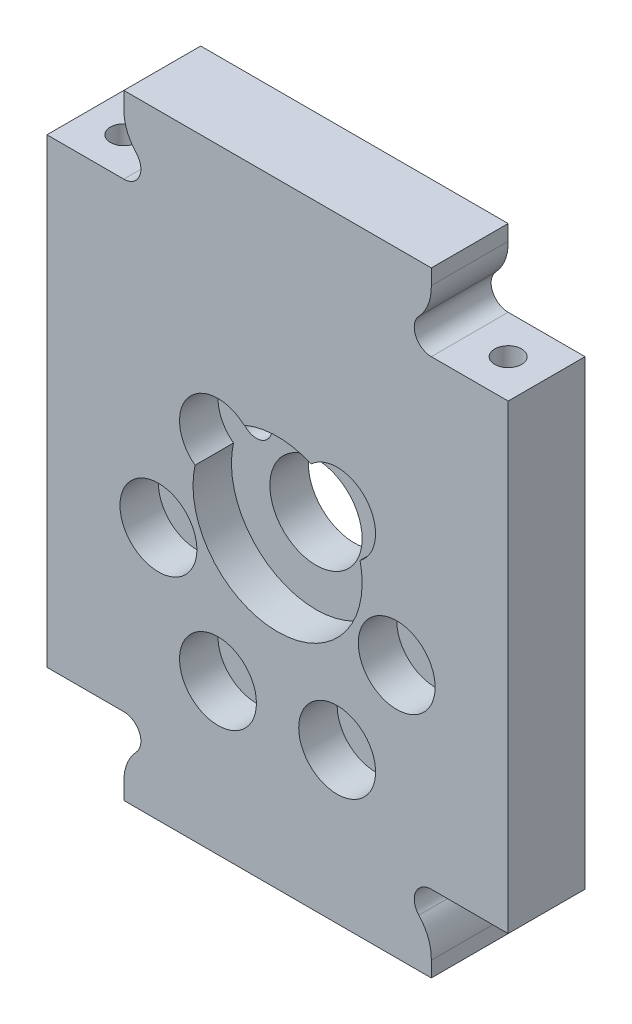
from build123d import *

# Parameters (mm, degrees)
BOSS_EXTRU_1_DEPTH              = 10
ESQUISSE3_R                     = 6
ENL_V_MAT_EXTRU_2_DEPTH         = 44.588989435
BOSS_EXTRU_2_DEPTH              = 10
DIAM_TRE_DU_PER_AGE_3_5_3_5_2_D = 3.5
ESQUISSE11_R                    = 2
ENL_V_MAT_EXTRU_3_DEPTH         = 10
ESQUISSE13_R                    = 5
ENL_V_MAT_EXTRU_6_DEPTH         = 5
R_P_TITION_CIRCULAIRE1_COUNT    = 6
ESQUISSE14_R                    = 11
ENL_V_MAT_EXTRU_7_DEPTH         = 5


with BuildPart() as part:
    # Esquisse1 → Boss.-Extru.1 (new body)
    with BuildSketch(Plane.XY):
        Polygon((30, 30), (-30, 30), (-29.99782814, -30), (29.99782814, -30), align=None)
    extrude(amount=BOSS_EXTRU_1_DEPTH)

    # Esquisse3 → Enl_v. mat.-Extru.2 (cut, through all)
    with BuildSketch(Plane.XY.offset(10)):
        Circle(ESQUISSE3_R)
    extrude(amount=-ENL_V_MAT_EXTRU_2_DEPTH, mode=Mode.SUBTRACT)

    # Esquisse8 → Boss.-Extru.2 (add)
    with BuildSketch(Plane.XY.offset(10)):
        with BuildLine():
            Line((-20, 38), (-20, 40))
            Line((-20, 40), (20, 40))
            Line((20, 40), (20, 38))
            ThreePointArc((20, 38), (19.61067292, 35.709155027), (18.380132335, 33.738034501))
            ThreePointArc((18.380132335, 33.738034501), (17.963036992, 31.337287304), (20, 30))
            Line((20, 30), (-20, 30))
            ThreePointArc((-20, 30), (-17.963036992, 31.337287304), (-18.380132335, 33.738034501))
            ThreePointArc((-18.380132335, 33.738034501), (-19.61067292, 35.709155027), (-20, 38))
        make_face()
    boss_extru_2 = extrude(amount=-BOSS_EXTRU_2_DEPTH)

    # Sym_trie2: Boss.-Extru.2 across plane
    add(boss_extru_2.mirror(Plane.ZX))

    # Diam_tre du per_age _3.5 _3.5_2 (through all)
    with Locations(Plane(origin=(0, 30, 0), x_dir=(1, 0, 0), z_dir=(0, 1, 0))):
        with Locations((25, -5), (-25, -5)):
            diam_tre_du_per_age_3_5_3_5_2 = Hole(DIAM_TRE_DU_PER_AGE_3_5_3_5_2_D / 2)

    # Sym_trie3: Diam_tre du per_age _3.5 _3.5_2 across plane
    add(diam_tre_du_per_age_3_5_3_5_2.mirror(Plane.ZX), mode=Mode.SUBTRACT)

    # Esquisse11 → Enl_v. mat.-Extru.3 (cut)
    with BuildSketch(Plane.XY.offset(10)):
        with Locations((-7.75, -20.423393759)):
            Circle(ESQUISSE11_R)
    enl_v_mat_extru_3 = extrude(amount=-ENL_V_MAT_EXTRU_3_DEPTH, mode=Mode.SUBTRACT)

    # Esquisse13 → Enl_v. mat.-Extru.6 (cut)
    with BuildSketch(Plane.XY.offset(10)):
        with Locations((-7.75, -20.423393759)):
            Circle(ESQUISSE13_R)
    enl_v_mat_extru_6 = extrude(amount=-ENL_V_MAT_EXTRU_6_DEPTH, mode=Mode.SUBTRACT)

    # R_p_tition circulaire1: Enl_v. mat.-Extru.3, Enl_v. mat.-Extru.6 ×6 about axis
    r_p_tition_circulaire1_axis = Axis((0, -7, 0), (0, 0, 1))
    add([enl_v_mat_extru_3.rotate(r_p_tition_circulaire1_axis, i * 360 / R_P_TITION_CIRCULAIRE1_COUNT) for i in range(1, R_P_TITION_CIRCULAIRE1_COUNT)], mode=Mode.SUBTRACT)
    add([enl_v_mat_extru_6.rotate(r_p_tition_circulaire1_axis, i * 360 / R_P_TITION_CIRCULAIRE1_COUNT) for i in range(1, R_P_TITION_CIRCULAIRE1_COUNT)], mode=Mode.SUBTRACT)

    # Esquisse14 → Enl_v. mat.-Extru.7 (cut)
    with BuildSketch(Plane.XY.offset(10)):
        Circle(ESQUISSE14_R)
    extrude(amount=-ENL_V_MAT_EXTRU_7_DEPTH, mode=Mode.SUBTRACT)


solid = part.part
